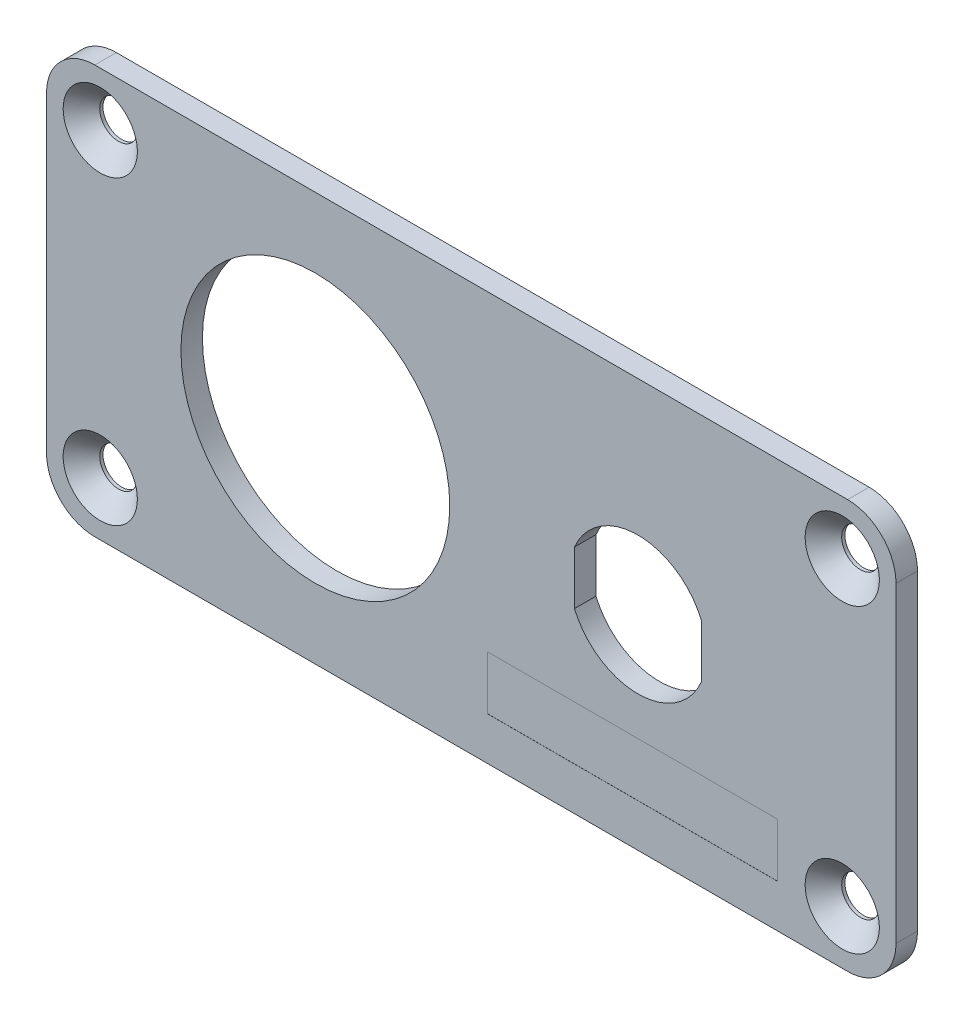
ISO-10303-21;
HEADER;
FILE_DESCRIPTION(('STEP AP214'),'2;1');
FILE_NAME('part.step','',(''),(''),'','','');
FILE_SCHEMA(('AUTOMOTIVE_DESIGN { 1 0 10303 214 1 1 1 1 }'));
ENDSEC;
DATA;
#1=APPLICATION_CONTEXT('core data for automotive mechanical design processes');
#2=APPLICATION_PROTOCOL_DEFINITION('international standard','automotive_design',2000,#1);
#3=PRODUCT_CONTEXT('',#1,'mechanical');
#4=PRODUCT('Part','Part','',(#3));
#5=PRODUCT_RELATED_PRODUCT_CATEGORY('part','',(#4));
#6=PRODUCT_DEFINITION_FORMATION('','',#4);
#7=PRODUCT_DEFINITION_CONTEXT('part definition',#1,'design');
#8=PRODUCT_DEFINITION('design','',#6,#7);
#9=PRODUCT_DEFINITION_SHAPE('','',#8);
#10=(LENGTH_UNIT() NAMED_UNIT(*) SI_UNIT(.MILLI.,.METRE.));
#11=(NAMED_UNIT(*) PLANE_ANGLE_UNIT() SI_UNIT($,.RADIAN.));
#12=(NAMED_UNIT(*) SI_UNIT($,.STERADIAN.) SOLID_ANGLE_UNIT());
#13=UNCERTAINTY_MEASURE_WITH_UNIT(LENGTH_MEASURE(1.E-05),#10,'distance_accuracy_value','');
#14=(GEOMETRIC_REPRESENTATION_CONTEXT(3) GLOBAL_UNCERTAINTY_ASSIGNED_CONTEXT((#13)) GLOBAL_UNIT_ASSIGNED_CONTEXT((#10,
#11,#12)) REPRESENTATION_CONTEXT('',''));
#15=CARTESIAN_POINT('',(0.,0.,0.));
#16=DIRECTION('',(0.,0.,1.));
#17=DIRECTION('',(1.,0.,0.));
#18=AXIS2_PLACEMENT_3D('',#15,#16,#17);
#19=CARTESIAN_POINT('',(0.,0.,2.));
#20=DIRECTION('',(1.,0.,0.));
#21=DIRECTION('',(0.,0.,-1.));
#22=AXIS2_PLACEMENT_3D('',#19,#20,#21);
#23=PLANE('',#22);
#24=DIRECTION('',(0.,-1.,0.));
#25=VECTOR('',#24,1.);
#26=CARTESIAN_POINT('',(0.,0.,2.));
#27=LINE('',#26,#25);
#28=CARTESIAN_POINT('',(0.,33.5,2.));
#29=VERTEX_POINT('',#28);
#30=CARTESIAN_POINT('',(0.,4.5,2.));
#31=VERTEX_POINT('',#30);
#32=EDGE_CURVE('E244',#29,#31,#27,.T.);
#33=ORIENTED_EDGE('',*,*,#32,.F.);
#34=DIRECTION('',(0.,0.,-1.));
#35=VECTOR('',#34,1.);
#36=CARTESIAN_POINT('',(0.,33.5,2.));
#37=LINE('',#36,#35);
#38=CARTESIAN_POINT('',(0.,33.5,0.));
#39=VERTEX_POINT('',#38);
#40=EDGE_CURVE('E300',#29,#39,#37,.T.);
#41=ORIENTED_EDGE('',*,*,#40,.T.);
#42=DIRECTION('',(0.,-1.,0.));
#43=VECTOR('',#42,1.);
#44=CARTESIAN_POINT('',(0.,0.,0.));
#45=LINE('',#44,#43);
#46=CARTESIAN_POINT('',(0.,4.5,0.));
#47=VERTEX_POINT('',#46);
#48=EDGE_CURVE('E243',#39,#47,#45,.T.);
#49=ORIENTED_EDGE('',*,*,#48,.T.);
#50=DIRECTION('',(0.,0.,-1.));
#51=VECTOR('',#50,1.);
#52=CARTESIAN_POINT('',(0.,4.5,2.));
#53=LINE('',#52,#51);
#54=EDGE_CURVE('E298',#47,#31,#53,.F.);
#55=ORIENTED_EDGE('',*,*,#54,.T.);
#56=EDGE_LOOP('',(#33,#41,#49,#55));
#57=FACE_BOUND('',#56,.T.);
#58=ADVANCED_FACE('F44',(#57),#23,.F.);
#59=CARTESIAN_POINT('',(0.,0.,2.));
#60=DIRECTION('',(0.,1.,0.));
#61=DIRECTION('',(0.,0.,1.));
#62=AXIS2_PLACEMENT_3D('',#59,#60,#61);
#63=PLANE('',#62);
#64=DIRECTION('',(1.,0.,0.));
#65=VECTOR('',#64,1.);
#66=CARTESIAN_POINT('',(0.,0.,0.));
#67=LINE('',#66,#65);
#68=CARTESIAN_POINT('',(4.5,0.,0.));
#69=VERTEX_POINT('',#68);
#70=CARTESIAN_POINT('',(74.5,0.,0.));
#71=VERTEX_POINT('',#70);
#72=EDGE_CURVE('E260',#69,#71,#67,.T.);
#73=ORIENTED_EDGE('',*,*,#72,.T.);
#74=DIRECTION('',(0.,0.,-1.));
#75=VECTOR('',#74,1.);
#76=CARTESIAN_POINT('',(74.5,0.,2.));
#77=LINE('',#76,#75);
#78=CARTESIAN_POINT('',(74.5,0.,2.));
#79=VERTEX_POINT('',#78);
#80=EDGE_CURVE('E283',#71,#79,#77,.F.);
#81=ORIENTED_EDGE('',*,*,#80,.T.);
#82=DIRECTION('',(1.,0.,0.));
#83=VECTOR('',#82,1.);
#84=CARTESIAN_POINT('',(0.,0.,2.));
#85=LINE('',#84,#83);
#86=CARTESIAN_POINT('',(4.5,0.,2.));
#87=VERTEX_POINT('',#86);
#88=EDGE_CURVE('E247',#87,#79,#85,.T.);
#89=ORIENTED_EDGE('',*,*,#88,.F.);
#90=DIRECTION('',(0.,0.,-1.));
#91=VECTOR('',#90,1.);
#92=CARTESIAN_POINT('',(4.5,0.,2.));
#93=LINE('',#92,#91);
#94=EDGE_CURVE('E280',#87,#69,#93,.T.);
#95=ORIENTED_EDGE('',*,*,#94,.T.);
#96=EDGE_LOOP('',(#73,#81,#89,#95));
#97=FACE_BOUND('',#96,.T.);
#98=ADVANCED_FACE('F340',(#97),#63,.F.);
#99=CARTESIAN_POINT('',(79.,0.,2.));
#100=DIRECTION('',(-1.,0.,0.));
#101=DIRECTION('',(0.,0.,1.));
#102=AXIS2_PLACEMENT_3D('',#99,#100,#101);
#103=PLANE('',#102);
#104=DIRECTION('',(0.,1.,0.));
#105=VECTOR('',#104,1.);
#106=CARTESIAN_POINT('',(79.,0.,2.));
#107=LINE('',#106,#105);
#108=CARTESIAN_POINT('',(79.,4.5,2.));
#109=VERTEX_POINT('',#108);
#110=CARTESIAN_POINT('',(79.,33.5,2.));
#111=VERTEX_POINT('',#110);
#112=EDGE_CURVE('E251',#109,#111,#107,.T.);
#113=ORIENTED_EDGE('',*,*,#112,.F.);
#114=DIRECTION('',(0.,0.,-1.));
#115=VECTOR('',#114,1.);
#116=CARTESIAN_POINT('',(79.,4.5,2.));
#117=LINE('',#116,#115);
#118=CARTESIAN_POINT('',(79.,4.5,0.));
#119=VERTEX_POINT('',#118);
#120=EDGE_CURVE('E269',#109,#119,#117,.T.);
#121=ORIENTED_EDGE('',*,*,#120,.T.);
#122=DIRECTION('',(0.,1.,0.));
#123=VECTOR('',#122,1.);
#124=CARTESIAN_POINT('',(79.,0.,0.));
#125=LINE('',#124,#123);
#126=CARTESIAN_POINT('',(79.,33.5,0.));
#127=VERTEX_POINT('',#126);
#128=EDGE_CURVE('E263',#119,#127,#125,.T.);
#129=ORIENTED_EDGE('',*,*,#128,.T.);
#130=DIRECTION('',(0.,0.,-1.));
#131=VECTOR('',#130,1.);
#132=CARTESIAN_POINT('',(79.,33.5,2.));
#133=LINE('',#132,#131);
#134=EDGE_CURVE('E257',#127,#111,#133,.F.);
#135=ORIENTED_EDGE('',*,*,#134,.T.);
#136=EDGE_LOOP('',(#113,#121,#129,#135));
#137=FACE_BOUND('',#136,.T.);
#138=ADVANCED_FACE('F346',(#137),#103,.F.);
#139=CARTESIAN_POINT('',(0.,38.,2.));
#140=DIRECTION('',(0.,-1.,0.));
#141=DIRECTION('',(0.,0.,-1.));
#142=AXIS2_PLACEMENT_3D('',#139,#140,#141);
#143=PLANE('',#142);
#144=DIRECTION('',(-1.,0.,0.));
#145=VECTOR('',#144,1.);
#146=CARTESIAN_POINT('',(0.,38.,2.));
#147=LINE('',#146,#145);
#148=CARTESIAN_POINT('',(74.5,38.,2.));
#149=VERTEX_POINT('',#148);
#150=CARTESIAN_POINT('',(4.5,38.,2.));
#151=VERTEX_POINT('',#150);
#152=EDGE_CURVE('E254',#149,#151,#147,.T.);
#153=ORIENTED_EDGE('',*,*,#152,.F.);
#154=DIRECTION('',(0.,0.,-1.));
#155=VECTOR('',#154,1.);
#156=CARTESIAN_POINT('',(74.5,38.,2.));
#157=LINE('',#156,#155);
#158=CARTESIAN_POINT('',(74.5,38.,0.));
#159=VERTEX_POINT('',#158);
#160=EDGE_CURVE('E295',#149,#159,#157,.T.);
#161=ORIENTED_EDGE('',*,*,#160,.T.);
#162=DIRECTION('',(-1.,0.,0.));
#163=VECTOR('',#162,1.);
#164=CARTESIAN_POINT('',(0.,38.,0.));
#165=LINE('',#164,#163);
#166=CARTESIAN_POINT('',(4.5,38.,0.));
#167=VERTEX_POINT('',#166);
#168=EDGE_CURVE('E248',#159,#167,#165,.T.);
#169=ORIENTED_EDGE('',*,*,#168,.T.);
#170=DIRECTION('',(0.,0.,-1.));
#171=VECTOR('',#170,1.);
#172=CARTESIAN_POINT('',(4.5,38.,2.));
#173=LINE('',#172,#171);
#174=EDGE_CURVE('E293',#167,#151,#173,.F.);
#175=ORIENTED_EDGE('',*,*,#174,.T.);
#176=EDGE_LOOP('',(#153,#161,#169,#175));
#177=FACE_BOUND('',#176,.T.);
#178=ADVANCED_FACE('F412',(#177),#143,.F.);
#179=CARTESIAN_POINT('',(0.,0.,2.));
#180=DIRECTION('',(0.,0.,-1.));
#181=DIRECTION('',(-1.,0.,0.));
#182=AXIS2_PLACEMENT_3D('',#179,#180,#181);
#183=PLANE('',#182);
#184=DIRECTION('',(1.,0.,0.));
#185=VECTOR('',#184,1.);
#186=CARTESIAN_POINT('',(41.,4.,2.));
#187=LINE('',#186,#185);
#188=CARTESIAN_POINT('',(41.,4.,2.));
#189=VERTEX_POINT('',#188);
#190=CARTESIAN_POINT('',(68.,4.,2.));
#191=VERTEX_POINT('',#190);
#192=EDGE_CURVE('E186',#189,#191,#187,.T.);
#193=ORIENTED_EDGE('',*,*,#192,.F.);
#194=DIRECTION('',(0.,-1.,0.));
#195=VECTOR('',#194,1.);
#196=CARTESIAN_POINT('',(41.,9.,2.));
#197=LINE('',#196,#195);
#198=CARTESIAN_POINT('',(41.,9.,2.));
#199=VERTEX_POINT('',#198);
#200=EDGE_CURVE('E59',#199,#189,#197,.T.);
#201=ORIENTED_EDGE('',*,*,#200,.F.);
#202=DIRECTION('',(-1.,0.,0.));
#203=VECTOR('',#202,1.);
#204=CARTESIAN_POINT('',(41.,9.,2.));
#205=LINE('',#204,#203);
#206=CARTESIAN_POINT('',(68.,9.,2.));
#207=VERTEX_POINT('',#206);
#208=EDGE_CURVE('E177',#207,#199,#205,.T.);
#209=ORIENTED_EDGE('',*,*,#208,.F.);
#210=DIRECTION('',(0.,1.,0.));
#211=VECTOR('',#210,1.);
#212=CARTESIAN_POINT('',(68.,9.,2.));
#213=LINE('',#212,#211);
#214=EDGE_CURVE('E180',#191,#207,#213,.T.);
#215=ORIENTED_EDGE('',*,*,#214,.F.);
#216=EDGE_LOOP('',(#193,#201,#209,#215));
#217=FACE_BOUND('',#216,.T.);
#218=CARTESIAN_POINT('',(74.,33.,2.));
#219=DIRECTION('',(0.,0.,-1.));
#220=DIRECTION('',(-1.,0.,0.));
#221=AXIS2_PLACEMENT_3D('',#218,#219,#220);
#222=CIRCLE('',#221,3.44999999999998);
#223=CARTESIAN_POINT('',(70.55,33.,2.));
#224=VERTEX_POINT('',#223);
#225=EDGE_CURVE('E315',#224,#224,#222,.T.);
#226=ORIENTED_EDGE('',*,*,#225,.T.);
#227=EDGE_LOOP('',(#226));
#228=FACE_BOUND('',#227,.T.);
#229=CARTESIAN_POINT('',(74.,5.,2.));
#230=DIRECTION('',(0.,0.,-1.));
#231=DIRECTION('',(-1.,0.,0.));
#232=AXIS2_PLACEMENT_3D('',#229,#230,#231);
#233=CIRCLE('',#232,3.44999999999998);
#234=CARTESIAN_POINT('',(70.55,5.,2.));
#235=VERTEX_POINT('',#234);
#236=EDGE_CURVE('E312',#235,#235,#233,.T.);
#237=ORIENTED_EDGE('',*,*,#236,.T.);
#238=EDGE_LOOP('',(#237));
#239=FACE_BOUND('',#238,.T.);
#240=CARTESIAN_POINT('',(5.,5.,2.));
#241=DIRECTION('',(0.,0.,-1.));
#242=DIRECTION('',(-1.,0.,0.));
#243=AXIS2_PLACEMENT_3D('',#240,#241,#242);
#244=CIRCLE('',#243,3.44999999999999);
#245=CARTESIAN_POINT('',(8.44999999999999,5.,2.));
#246=VERTEX_POINT('',#245);
#247=EDGE_CURVE('E309',#246,#246,#244,.T.);
#248=ORIENTED_EDGE('',*,*,#247,.T.);
#249=EDGE_LOOP('',(#248));
#250=FACE_BOUND('',#249,.T.);
#251=CARTESIAN_POINT('',(4.99999999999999,33.,2.));
#252=DIRECTION('',(0.,0.,-1.));
#253=DIRECTION('',(-1.,0.,0.));
#254=AXIS2_PLACEMENT_3D('',#251,#252,#253);
#255=CIRCLE('',#254,3.45000000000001);
#256=CARTESIAN_POINT('',(1.54999999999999,33.,2.));
#257=VERTEX_POINT('',#256);
#258=EDGE_CURVE('E306',#257,#257,#255,.T.);
#259=ORIENTED_EDGE('',*,*,#258,.T.);
#260=EDGE_LOOP('',(#259));
#261=FACE_BOUND('',#260,.T.);
#262=CARTESIAN_POINT('',(25.,19.,2.));
#263=DIRECTION('',(0.,0.,1.));
#264=DIRECTION('',(1.,0.,0.));
#265=AXIS2_PLACEMENT_3D('',#262,#263,#264);
#266=CIRCLE('',#265,12.5);
#267=CARTESIAN_POINT('',(37.5,19.,2.));
#268=VERTEX_POINT('',#267);
#269=EDGE_CURVE('E199',#268,#268,#266,.T.);
#270=ORIENTED_EDGE('',*,*,#269,.F.);
#271=EDGE_LOOP('',(#270));
#272=FACE_BOUND('',#271,.T.);
#273=DIRECTION('',(0.,-1.,0.));
#274=VECTOR('',#273,1.);
#275=CARTESIAN_POINT('',(49.1,21.4799193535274,2.));
#276=LINE('',#275,#274);
#277=CARTESIAN_POINT('',(49.1,21.4799193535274,2.));
#278=VERTEX_POINT('',#277);
#279=CARTESIAN_POINT('',(49.1,16.5200806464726,2.));
#280=VERTEX_POINT('',#279);
#281=EDGE_CURVE('E218',#278,#280,#276,.T.);
#282=ORIENTED_EDGE('',*,*,#281,.F.);
#283=CARTESIAN_POINT('',(55.,19.,2.));
#284=DIRECTION('',(0.,0.,1.));
#285=DIRECTION('',(1.,0.,0.));
#286=AXIS2_PLACEMENT_3D('',#283,#284,#285);
#287=CIRCLE('',#286,6.4);
#288=CARTESIAN_POINT('',(60.9,21.4799193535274,2.));
#289=VERTEX_POINT('',#288);
#290=EDGE_CURVE('E67',#289,#278,#287,.T.);
#291=ORIENTED_EDGE('',*,*,#290,.F.);
#292=DIRECTION('',(0.,1.,0.));
#293=VECTOR('',#292,1.);
#294=CARTESIAN_POINT('',(60.9,21.4799193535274,2.));
#295=LINE('',#294,#293);
#296=CARTESIAN_POINT('',(60.9,16.5200806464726,2.));
#297=VERTEX_POINT('',#296);
#298=EDGE_CURVE('E207',#297,#289,#295,.T.);
#299=ORIENTED_EDGE('',*,*,#298,.F.);
#300=CARTESIAN_POINT('',(55.,19.,2.));
#301=DIRECTION('',(0.,0.,1.));
#302=DIRECTION('',(1.,0.,0.));
#303=AXIS2_PLACEMENT_3D('',#300,#301,#302);
#304=CIRCLE('',#303,6.4);
#305=EDGE_CURVE('E221',#280,#297,#304,.T.);
#306=ORIENTED_EDGE('',*,*,#305,.F.);
#307=EDGE_LOOP('',(#282,#291,#299,#306));
#308=FACE_BOUND('',#307,.T.);
#309=ORIENTED_EDGE('',*,*,#88,.T.);
#310=CARTESIAN_POINT('',(74.5,4.5,2.));
#311=DIRECTION('',(0.,0.,-1.));
#312=DIRECTION('',(-1.,0.,0.));
#313=AXIS2_PLACEMENT_3D('',#310,#311,#312);
#314=CIRCLE('',#313,4.5);
#315=EDGE_CURVE('E291',#79,#109,#314,.F.);
#316=ORIENTED_EDGE('',*,*,#315,.T.);
#317=ORIENTED_EDGE('',*,*,#112,.T.);
#318=CARTESIAN_POINT('',(74.5,33.5,2.));
#319=DIRECTION('',(0.,0.,-1.));
#320=DIRECTION('',(-1.,0.,0.));
#321=AXIS2_PLACEMENT_3D('',#318,#319,#320);
#322=CIRCLE('',#321,4.5);
#323=EDGE_CURVE('E289',#111,#149,#322,.F.);
#324=ORIENTED_EDGE('',*,*,#323,.T.);
#325=ORIENTED_EDGE('',*,*,#152,.T.);
#326=CARTESIAN_POINT('',(4.5,33.5,2.));
#327=DIRECTION('',(0.,0.,-1.));
#328=DIRECTION('',(-1.,0.,0.));
#329=AXIS2_PLACEMENT_3D('',#326,#327,#328);
#330=CIRCLE('',#329,4.5);
#331=EDGE_CURVE('E287',#151,#29,#330,.F.);
#332=ORIENTED_EDGE('',*,*,#331,.T.);
#333=ORIENTED_EDGE('',*,*,#32,.T.);
#334=CARTESIAN_POINT('',(4.5,4.5,2.));
#335=DIRECTION('',(0.,0.,-1.));
#336=DIRECTION('',(-1.,0.,0.));
#337=AXIS2_PLACEMENT_3D('',#334,#335,#336);
#338=CIRCLE('',#337,4.5);
#339=EDGE_CURVE('E285',#31,#87,#338,.F.);
#340=ORIENTED_EDGE('',*,*,#339,.T.);
#341=EDGE_LOOP('',(#309,#316,#317,#324,#325,#332,#333,#340));
#342=FACE_BOUND('',#341,.T.);
#343=ADVANCED_FACE('F392',(#217,#228,#239,#250,#261,#272,#308,#342),#183,.F.);
#344=CARTESIAN_POINT('',(0.,0.,0.));
#345=DIRECTION('',(0.,0.,-1.));
#346=DIRECTION('',(-1.,0.,0.));
#347=AXIS2_PLACEMENT_3D('',#344,#345,#346);
#348=PLANE('',#347);
#349=CARTESIAN_POINT('',(25.,19.,0.));
#350=DIRECTION('',(0.,0.,1.));
#351=DIRECTION('',(1.,0.,0.));
#352=AXIS2_PLACEMENT_3D('',#349,#350,#351);
#353=CIRCLE('',#352,12.5);
#354=CARTESIAN_POINT('',(37.5,19.,0.));
#355=VERTEX_POINT('',#354);
#356=EDGE_CURVE('E195',#355,#355,#353,.T.);
#357=ORIENTED_EDGE('',*,*,#356,.T.);
#358=EDGE_LOOP('',(#357));
#359=FACE_BOUND('',#358,.T.);
#360=CARTESIAN_POINT('',(55.,19.,0.));
#361=DIRECTION('',(0.,0.,1.));
#362=DIRECTION('',(1.,0.,0.));
#363=AXIS2_PLACEMENT_3D('',#360,#361,#362);
#364=CIRCLE('',#363,6.4);
#365=CARTESIAN_POINT('',(60.9,21.4799193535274,0.));
#366=VERTEX_POINT('',#365);
#367=CARTESIAN_POINT('',(49.1,21.4799193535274,0.));
#368=VERTEX_POINT('',#367);
#369=EDGE_CURVE('E203',#366,#368,#364,.T.);
#370=ORIENTED_EDGE('',*,*,#369,.T.);
#371=DIRECTION('',(0.,-1.,0.));
#372=VECTOR('',#371,1.);
#373=CARTESIAN_POINT('',(49.1,21.4799193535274,0.));
#374=LINE('',#373,#372);
#375=CARTESIAN_POINT('',(49.1,16.5200806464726,0.));
#376=VERTEX_POINT('',#375);
#377=EDGE_CURVE('E206',#368,#376,#374,.T.);
#378=ORIENTED_EDGE('',*,*,#377,.T.);
#379=CARTESIAN_POINT('',(55.,19.,0.));
#380=DIRECTION('',(0.,0.,1.));
#381=DIRECTION('',(1.,0.,0.));
#382=AXIS2_PLACEMENT_3D('',#379,#380,#381);
#383=CIRCLE('',#382,6.4);
#384=CARTESIAN_POINT('',(60.9,16.5200806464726,0.));
#385=VERTEX_POINT('',#384);
#386=EDGE_CURVE('E210',#376,#385,#383,.T.);
#387=ORIENTED_EDGE('',*,*,#386,.T.);
#388=DIRECTION('',(0.,1.,0.));
#389=VECTOR('',#388,1.);
#390=CARTESIAN_POINT('',(60.9,21.4799193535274,0.));
#391=LINE('',#390,#389);
#392=EDGE_CURVE('E213',#385,#366,#391,.T.);
#393=ORIENTED_EDGE('',*,*,#392,.T.);
#394=EDGE_LOOP('',(#370,#378,#387,#393));
#395=FACE_BOUND('',#394,.T.);
#396=CARTESIAN_POINT('',(5.,5.,0.));
#397=DIRECTION('',(0.,0.,1.));
#398=DIRECTION('',(1.,0.,0.));
#399=AXIS2_PLACEMENT_3D('',#396,#397,#398);
#400=CIRCLE('',#399,1.75);
#401=CARTESIAN_POINT('',(6.75,5.,0.));
#402=VERTEX_POINT('',#401);
#403=EDGE_CURVE('E235',#402,#402,#400,.T.);
#404=ORIENTED_EDGE('',*,*,#403,.T.);
#405=EDGE_LOOP('',(#404));
#406=FACE_BOUND('',#405,.T.);
#407=CARTESIAN_POINT('',(74.,33.,0.));
#408=DIRECTION('',(0.,0.,1.));
#409=DIRECTION('',(1.,0.,0.));
#410=AXIS2_PLACEMENT_3D('',#407,#408,#409);
#411=CIRCLE('',#410,1.75);
#412=CARTESIAN_POINT('',(75.75,33.,0.));
#413=VERTEX_POINT('',#412);
#414=EDGE_CURVE('E234',#413,#413,#411,.T.);
#415=ORIENTED_EDGE('',*,*,#414,.T.);
#416=EDGE_LOOP('',(#415));
#417=FACE_BOUND('',#416,.T.);
#418=CARTESIAN_POINT('',(74.,5.,0.));
#419=DIRECTION('',(0.,0.,1.));
#420=DIRECTION('',(1.,0.,0.));
#421=AXIS2_PLACEMENT_3D('',#418,#419,#420);
#422=CIRCLE('',#421,1.75);
#423=CARTESIAN_POINT('',(75.75,5.,0.));
#424=VERTEX_POINT('',#423);
#425=EDGE_CURVE('E198',#424,#424,#422,.T.);
#426=ORIENTED_EDGE('',*,*,#425,.T.);
#427=EDGE_LOOP('',(#426));
#428=FACE_BOUND('',#427,.T.);
#429=CARTESIAN_POINT('',(4.99999999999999,33.,0.));
#430=DIRECTION('',(0.,0.,1.));
#431=DIRECTION('',(1.,0.,0.));
#432=AXIS2_PLACEMENT_3D('',#429,#430,#431);
#433=CIRCLE('',#432,1.75);
#434=CARTESIAN_POINT('',(6.75,33.,0.));
#435=VERTEX_POINT('',#434);
#436=EDGE_CURVE('E238',#435,#435,#433,.T.);
#437=ORIENTED_EDGE('',*,*,#436,.T.);
#438=EDGE_LOOP('',(#437));
#439=FACE_BOUND('',#438,.T.);
#440=ORIENTED_EDGE('',*,*,#128,.F.);
#441=CARTESIAN_POINT('',(74.5,4.5,0.));
#442=DIRECTION('',(0.,0.,-1.));
#443=DIRECTION('',(-1.,0.,0.));
#444=AXIS2_PLACEMENT_3D('',#441,#442,#443);
#445=CIRCLE('',#444,4.5);
#446=EDGE_CURVE('E278',#119,#71,#445,.T.);
#447=ORIENTED_EDGE('',*,*,#446,.T.);
#448=ORIENTED_EDGE('',*,*,#72,.F.);
#449=CARTESIAN_POINT('',(4.5,4.5,0.));
#450=DIRECTION('',(0.,0.,-1.));
#451=DIRECTION('',(-1.,0.,0.));
#452=AXIS2_PLACEMENT_3D('',#449,#450,#451);
#453=CIRCLE('',#452,4.5);
#454=EDGE_CURVE('E272',#69,#47,#453,.T.);
#455=ORIENTED_EDGE('',*,*,#454,.T.);
#456=ORIENTED_EDGE('',*,*,#48,.F.);
#457=CARTESIAN_POINT('',(4.5,33.5,0.));
#458=DIRECTION('',(0.,0.,-1.));
#459=DIRECTION('',(-1.,0.,0.));
#460=AXIS2_PLACEMENT_3D('',#457,#458,#459);
#461=CIRCLE('',#460,4.5);
#462=EDGE_CURVE('E274',#39,#167,#461,.T.);
#463=ORIENTED_EDGE('',*,*,#462,.T.);
#464=ORIENTED_EDGE('',*,*,#168,.F.);
#465=CARTESIAN_POINT('',(74.5,33.5,0.));
#466=DIRECTION('',(0.,0.,-1.));
#467=DIRECTION('',(-1.,0.,0.));
#468=AXIS2_PLACEMENT_3D('',#465,#466,#467);
#469=CIRCLE('',#468,4.5);
#470=EDGE_CURVE('E276',#159,#127,#469,.T.);
#471=ORIENTED_EDGE('',*,*,#470,.T.);
#472=EDGE_LOOP('',(#440,#447,#448,#455,#456,#463,#464,#471));
#473=FACE_BOUND('',#472,.T.);
#474=ADVANCED_FACE('F356',(#359,#395,#406,#417,#428,#439,#473),#348,.T.);
#475=CARTESIAN_POINT('',(74.5,4.5,2.));
#476=DIRECTION('',(0.,0.,-1.));
#477=DIRECTION('',(-1.,0.,0.));
#478=AXIS2_PLACEMENT_3D('',#475,#476,#477);
#479=CYLINDRICAL_SURFACE('',#478,4.5);
#480=ORIENTED_EDGE('',*,*,#315,.F.);
#481=ORIENTED_EDGE('',*,*,#80,.F.);
#482=ORIENTED_EDGE('',*,*,#446,.F.);
#483=ORIENTED_EDGE('',*,*,#120,.F.);
#484=EDGE_LOOP('',(#480,#481,#482,#483));
#485=FACE_BOUND('',#484,.T.);
#486=ADVANCED_FACE('F352',(#485),#479,.T.);
#487=CARTESIAN_POINT('',(74.5,33.5,2.));
#488=DIRECTION('',(0.,0.,-1.));
#489=DIRECTION('',(-1.,0.,0.));
#490=AXIS2_PLACEMENT_3D('',#487,#488,#489);
#491=CYLINDRICAL_SURFACE('',#490,4.5);
#492=ORIENTED_EDGE('',*,*,#323,.F.);
#493=ORIENTED_EDGE('',*,*,#134,.F.);
#494=ORIENTED_EDGE('',*,*,#470,.F.);
#495=ORIENTED_EDGE('',*,*,#160,.F.);
#496=EDGE_LOOP('',(#492,#493,#494,#495));
#497=FACE_BOUND('',#496,.T.);
#498=ADVANCED_FACE('F355',(#497),#491,.T.);
#499=CARTESIAN_POINT('',(4.5,33.5,2.));
#500=DIRECTION('',(0.,0.,-1.));
#501=DIRECTION('',(-1.,0.,0.));
#502=AXIS2_PLACEMENT_3D('',#499,#500,#501);
#503=CYLINDRICAL_SURFACE('',#502,4.5);
#504=ORIENTED_EDGE('',*,*,#331,.F.);
#505=ORIENTED_EDGE('',*,*,#174,.F.);
#506=ORIENTED_EDGE('',*,*,#462,.F.);
#507=ORIENTED_EDGE('',*,*,#40,.F.);
#508=EDGE_LOOP('',(#504,#505,#506,#507));
#509=FACE_BOUND('',#508,.T.);
#510=ADVANCED_FACE('F360',(#509),#503,.T.);
#511=CARTESIAN_POINT('',(4.5,4.5,2.));
#512=DIRECTION('',(0.,0.,-1.));
#513=DIRECTION('',(-1.,0.,0.));
#514=AXIS2_PLACEMENT_3D('',#511,#512,#513);
#515=CYLINDRICAL_SURFACE('',#514,4.5);
#516=ORIENTED_EDGE('',*,*,#339,.F.);
#517=ORIENTED_EDGE('',*,*,#54,.F.);
#518=ORIENTED_EDGE('',*,*,#454,.F.);
#519=ORIENTED_EDGE('',*,*,#94,.F.);
#520=EDGE_LOOP('',(#516,#517,#518,#519));
#521=FACE_BOUND('',#520,.T.);
#522=ADVANCED_FACE('F364',(#521),#515,.T.);
#523=CARTESIAN_POINT('',(4.99999999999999,33.,0.));
#524=DIRECTION('',(0.,0.,1.));
#525=DIRECTION('',(1.,0.,0.));
#526=AXIS2_PLACEMENT_3D('',#523,#524,#525);
#527=CYLINDRICAL_SURFACE('',#526,1.75);
#528=CARTESIAN_POINT('',(4.99999999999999,33.,0.3));
#529=DIRECTION('',(0.,0.,-1.));
#530=DIRECTION('',(-1.,0.,0.));
#531=AXIS2_PLACEMENT_3D('',#528,#529,#530);
#532=CIRCLE('',#531,1.75);
#533=CARTESIAN_POINT('',(3.24999999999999,33.,0.3));
#534=VERTEX_POINT('',#533);
#535=EDGE_CURVE('E11',#534,#534,#532,.F.);
#536=ORIENTED_EDGE('',*,*,#535,.T.);
#537=EDGE_LOOP('',(#536));
#538=FACE_BOUND('',#537,.T.);
#539=ORIENTED_EDGE('',*,*,#436,.F.);
#540=EDGE_LOOP('',(#539));
#541=FACE_BOUND('',#540,.T.);
#542=ADVANCED_FACE('F368',(#538,#541),#527,.F.);
#543=CARTESIAN_POINT('',(74.,5.,0.));
#544=DIRECTION('',(0.,0.,1.));
#545=DIRECTION('',(1.,0.,0.));
#546=AXIS2_PLACEMENT_3D('',#543,#544,#545);
#547=CYLINDRICAL_SURFACE('',#546,1.75);
#548=CARTESIAN_POINT('',(74.,5.,0.300000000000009));
#549=DIRECTION('',(0.,0.,-1.));
#550=DIRECTION('',(-1.,0.,0.));
#551=AXIS2_PLACEMENT_3D('',#548,#549,#550);
#552=CIRCLE('',#551,1.75);
#553=CARTESIAN_POINT('',(72.25,5.,0.300000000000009));
#554=VERTEX_POINT('',#553);
#555=EDGE_CURVE('E318',#554,#554,#552,.F.);
#556=ORIENTED_EDGE('',*,*,#555,.T.);
#557=EDGE_LOOP('',(#556));
#558=FACE_BOUND('',#557,.T.);
#559=ORIENTED_EDGE('',*,*,#425,.F.);
#560=EDGE_LOOP('',(#559));
#561=FACE_BOUND('',#560,.T.);
#562=ADVANCED_FACE('F386',(#558,#561),#547,.F.);
#563=CARTESIAN_POINT('',(74.,33.,0.));
#564=DIRECTION('',(0.,0.,1.));
#565=DIRECTION('',(1.,0.,0.));
#566=AXIS2_PLACEMENT_3D('',#563,#564,#565);
#567=CYLINDRICAL_SURFACE('',#566,1.75);
#568=CARTESIAN_POINT('',(74.,33.,0.300000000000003));
#569=DIRECTION('',(0.,0.,-1.));
#570=DIRECTION('',(-1.,0.,0.));
#571=AXIS2_PLACEMENT_3D('',#568,#569,#570);
#572=CIRCLE('',#571,1.75);
#573=CARTESIAN_POINT('',(72.25,33.,0.300000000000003));
#574=VERTEX_POINT('',#573);
#575=EDGE_CURVE('E303',#574,#574,#572,.F.);
#576=ORIENTED_EDGE('',*,*,#575,.T.);
#577=EDGE_LOOP('',(#576));
#578=FACE_BOUND('',#577,.T.);
#579=ORIENTED_EDGE('',*,*,#414,.F.);
#580=EDGE_LOOP('',(#579));
#581=FACE_BOUND('',#580,.T.);
#582=ADVANCED_FACE('F383',(#578,#581),#567,.F.);
#583=CARTESIAN_POINT('',(5.,5.,0.));
#584=DIRECTION('',(0.,0.,1.));
#585=DIRECTION('',(1.,0.,0.));
#586=AXIS2_PLACEMENT_3D('',#583,#584,#585);
#587=CYLINDRICAL_SURFACE('',#586,1.75);
#588=CARTESIAN_POINT('',(5.,5.,0.300000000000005));
#589=DIRECTION('',(0.,0.,-1.));
#590=DIRECTION('',(-1.,0.,0.));
#591=AXIS2_PLACEMENT_3D('',#588,#589,#590);
#592=CIRCLE('',#591,1.75);
#593=CARTESIAN_POINT('',(6.75,5.,0.300000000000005));
#594=VERTEX_POINT('',#593);
#595=EDGE_CURVE('E52',#594,#594,#592,.F.);
#596=ORIENTED_EDGE('',*,*,#595,.T.);
#597=EDGE_LOOP('',(#596));
#598=FACE_BOUND('',#597,.T.);
#599=ORIENTED_EDGE('',*,*,#403,.F.);
#600=EDGE_LOOP('',(#599));
#601=FACE_BOUND('',#600,.T.);
#602=ADVANCED_FACE('F323',(#598,#601),#587,.F.);
#603=CARTESIAN_POINT('',(55.,19.,0.));
#604=DIRECTION('',(0.,0.,1.));
#605=DIRECTION('',(1.,0.,0.));
#606=AXIS2_PLACEMENT_3D('',#603,#604,#605);
#607=CYLINDRICAL_SURFACE('',#606,6.4);
#608=ORIENTED_EDGE('',*,*,#290,.T.);
#609=DIRECTION('',(0.,0.,1.));
#610=VECTOR('',#609,1.);
#611=CARTESIAN_POINT('',(49.1,21.4799193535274,0.));
#612=LINE('',#611,#610);
#613=EDGE_CURVE('E216',#368,#278,#612,.T.);
#614=ORIENTED_EDGE('',*,*,#613,.F.);
#615=ORIENTED_EDGE('',*,*,#369,.F.);
#616=DIRECTION('',(0.,0.,1.));
#617=VECTOR('',#616,1.);
#618=CARTESIAN_POINT('',(60.9,21.4799193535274,0.));
#619=LINE('',#618,#617);
#620=EDGE_CURVE('E202',#366,#289,#619,.T.);
#621=ORIENTED_EDGE('',*,*,#620,.T.);
#622=EDGE_LOOP('',(#608,#614,#615,#621));
#623=FACE_BOUND('',#622,.T.);
#624=ADVANCED_FACE('F436',(#623),#607,.F.);
#625=CARTESIAN_POINT('',(60.9,21.4799193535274,0.));
#626=DIRECTION('',(1.,0.,0.));
#627=DIRECTION('',(0.,0.,-1.));
#628=AXIS2_PLACEMENT_3D('',#625,#626,#627);
#629=PLANE('',#628);
#630=ORIENTED_EDGE('',*,*,#298,.T.);
#631=ORIENTED_EDGE('',*,*,#620,.F.);
#632=ORIENTED_EDGE('',*,*,#392,.F.);
#633=DIRECTION('',(0.,0.,1.));
#634=VECTOR('',#633,1.);
#635=CARTESIAN_POINT('',(60.9,16.5200806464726,0.));
#636=LINE('',#635,#634);
#637=EDGE_CURVE('E227',#385,#297,#636,.T.);
#638=ORIENTED_EDGE('',*,*,#637,.T.);
#639=EDGE_LOOP('',(#630,#631,#632,#638));
#640=FACE_BOUND('',#639,.T.);
#641=ADVANCED_FACE('F442',(#640),#629,.F.);
#642=CARTESIAN_POINT('',(55.,19.,0.));
#643=DIRECTION('',(0.,0.,1.));
#644=DIRECTION('',(1.,0.,0.));
#645=AXIS2_PLACEMENT_3D('',#642,#643,#644);
#646=CYLINDRICAL_SURFACE('',#645,6.4);
#647=ORIENTED_EDGE('',*,*,#305,.T.);
#648=ORIENTED_EDGE('',*,*,#637,.F.);
#649=ORIENTED_EDGE('',*,*,#386,.F.);
#650=DIRECTION('',(0.,0.,1.));
#651=VECTOR('',#650,1.);
#652=CARTESIAN_POINT('',(49.1,16.5200806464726,0.));
#653=LINE('',#652,#651);
#654=EDGE_CURVE('E229',#376,#280,#653,.T.);
#655=ORIENTED_EDGE('',*,*,#654,.T.);
#656=EDGE_LOOP('',(#647,#648,#649,#655));
#657=FACE_BOUND('',#656,.T.);
#658=ADVANCED_FACE('F445',(#657),#646,.F.);
#659=CARTESIAN_POINT('',(49.1,21.4799193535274,0.));
#660=DIRECTION('',(-1.,0.,0.));
#661=DIRECTION('',(0.,0.,1.));
#662=AXIS2_PLACEMENT_3D('',#659,#660,#661);
#663=PLANE('',#662);
#664=ORIENTED_EDGE('',*,*,#281,.T.);
#665=ORIENTED_EDGE('',*,*,#654,.F.);
#666=ORIENTED_EDGE('',*,*,#377,.F.);
#667=ORIENTED_EDGE('',*,*,#613,.T.);
#668=EDGE_LOOP('',(#664,#665,#666,#667));
#669=FACE_BOUND('',#668,.T.);
#670=ADVANCED_FACE('F376',(#669),#663,.F.);
#671=CARTESIAN_POINT('',(25.,19.,0.));
#672=DIRECTION('',(0.,0.,1.));
#673=DIRECTION('',(1.,0.,0.));
#674=AXIS2_PLACEMENT_3D('',#671,#672,#673);
#675=CYLINDRICAL_SURFACE('',#674,12.5);
#676=ORIENTED_EDGE('',*,*,#356,.F.);
#677=EDGE_LOOP('',(#676));
#678=FACE_BOUND('',#677,.T.);
#679=ORIENTED_EDGE('',*,*,#269,.T.);
#680=EDGE_LOOP('',(#679));
#681=FACE_BOUND('',#680,.T.);
#682=ADVANCED_FACE('F371',(#678,#681),#675,.F.);
#683=CARTESIAN_POINT('',(74.,33.,0.300000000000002));
#684=DIRECTION('',(0.,0.,1.));
#685=DIRECTION('',(1.,0.,0.));
#686=AXIS2_PLACEMENT_3D('',#683,#684,#685);
#687=CONICAL_SURFACE('',#686,1.75,0.785398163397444);
#688=ORIENTED_EDGE('',*,*,#225,.F.);
#689=EDGE_LOOP('',(#688));
#690=FACE_BOUND('',#689,.T.);
#691=ORIENTED_EDGE('',*,*,#575,.F.);
#692=EDGE_LOOP('',(#691));
#693=FACE_BOUND('',#692,.T.);
#694=ADVANCED_FACE('F335',(#690,#693),#687,.F.);
#695=CARTESIAN_POINT('',(74.,5.,0.300000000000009));
#696=DIRECTION('',(0.,0.,1.));
#697=DIRECTION('',(1.,0.,0.));
#698=AXIS2_PLACEMENT_3D('',#695,#696,#697);
#699=CONICAL_SURFACE('',#698,1.75,0.785398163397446);
#700=ORIENTED_EDGE('',*,*,#236,.F.);
#701=EDGE_LOOP('',(#700));
#702=FACE_BOUND('',#701,.T.);
#703=ORIENTED_EDGE('',*,*,#555,.F.);
#704=EDGE_LOOP('',(#703));
#705=FACE_BOUND('',#704,.T.);
#706=ADVANCED_FACE('F328',(#702,#705),#699,.F.);
#707=CARTESIAN_POINT('',(5.,5.,0.300000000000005));
#708=DIRECTION('',(0.,0.,1.));
#709=DIRECTION('',(1.,0.,0.));
#710=AXIS2_PLACEMENT_3D('',#707,#708,#709);
#711=CONICAL_SURFACE('',#710,1.75,0.785398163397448);
#712=CARTESIAN_POINT('',(8.44999999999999,5.,2.));
#713=CARTESIAN_POINT('',(8.43229166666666,5.,1.98229166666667));
#714=CARTESIAN_POINT('',(8.41458333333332,5.,1.96458333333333));
#715=CARTESIAN_POINT('',(8.37916666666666,5.,1.92916666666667));
#716=CARTESIAN_POINT('',(8.36145833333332,5.,1.91145833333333));
#717=CARTESIAN_POINT('',(8.32604166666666,5.,1.87604166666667));
#718=CARTESIAN_POINT('',(8.30833333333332,5.,1.85833333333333));
#719=CARTESIAN_POINT('',(8.27291666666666,5.,1.82291666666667));
#720=CARTESIAN_POINT('',(8.25520833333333,5.,1.80520833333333));
#721=CARTESIAN_POINT('',(8.21979166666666,5.,1.76979166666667));
#722=CARTESIAN_POINT('',(8.20208333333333,5.,1.75208333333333));
#723=CARTESIAN_POINT('',(8.16666666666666,5.,1.71666666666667));
#724=CARTESIAN_POINT('',(8.14895833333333,5.,1.69895833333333));
#725=CARTESIAN_POINT('',(8.11354166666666,5.,1.66354166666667));
#726=CARTESIAN_POINT('',(8.09583333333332,5.,1.64583333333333));
#727=CARTESIAN_POINT('',(8.06041666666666,5.,1.61041666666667));
#728=CARTESIAN_POINT('',(8.04270833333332,5.,1.59270833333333));
#729=CARTESIAN_POINT('',(8.00729166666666,5.,1.55729166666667));
#730=CARTESIAN_POINT('',(7.98958333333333,5.,1.53958333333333));
#731=CARTESIAN_POINT('',(7.95416666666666,5.,1.50416666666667));
#732=CARTESIAN_POINT('',(7.93645833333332,5.,1.48645833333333));
#733=CARTESIAN_POINT('',(7.90104166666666,5.,1.45104166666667));
#734=CARTESIAN_POINT('',(7.88333333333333,5.,1.43333333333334));
#735=CARTESIAN_POINT('',(7.84791666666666,5.,1.39791666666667));
#736=CARTESIAN_POINT('',(7.83020833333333,5.,1.38020833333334));
#737=CARTESIAN_POINT('',(7.79479166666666,5.,1.34479166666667));
#738=CARTESIAN_POINT('',(7.77708333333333,5.,1.32708333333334));
#739=CARTESIAN_POINT('',(7.74166666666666,5.,1.29166666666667));
#740=CARTESIAN_POINT('',(7.72395833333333,5.,1.27395833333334));
#741=CARTESIAN_POINT('',(7.68854166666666,5.,1.23854166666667));
#742=CARTESIAN_POINT('',(7.67083333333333,5.,1.22083333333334));
#743=CARTESIAN_POINT('',(7.63541666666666,5.,1.18541666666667));
#744=CARTESIAN_POINT('',(7.61770833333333,5.,1.16770833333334));
#745=CARTESIAN_POINT('',(7.58229166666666,5.,1.13229166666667));
#746=CARTESIAN_POINT('',(7.56458333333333,5.,1.11458333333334));
#747=CARTESIAN_POINT('',(7.52916666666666,5.,1.07916666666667));
#748=CARTESIAN_POINT('',(7.51145833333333,5.,1.06145833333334));
#749=CARTESIAN_POINT('',(7.47604166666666,5.,1.02604166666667));
#750=CARTESIAN_POINT('',(7.45833333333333,5.,1.00833333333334));
#751=CARTESIAN_POINT('',(7.42291666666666,5.,0.97291666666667));
#752=CARTESIAN_POINT('',(7.40520833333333,5.,0.955208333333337));
#753=CARTESIAN_POINT('',(7.36979166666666,5.,0.91979166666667));
#754=CARTESIAN_POINT('',(7.35208333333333,5.,0.902083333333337));
#755=CARTESIAN_POINT('',(7.31666666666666,5.,0.86666666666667));
#756=CARTESIAN_POINT('',(7.29895833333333,5.,0.848958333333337));
#757=CARTESIAN_POINT('',(7.26354166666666,5.,0.81354166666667));
#758=CARTESIAN_POINT('',(7.24583333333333,5.,0.795833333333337));
#759=CARTESIAN_POINT('',(7.21041666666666,5.,0.760416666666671));
#760=CARTESIAN_POINT('',(7.19270833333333,5.,0.742708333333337));
#761=CARTESIAN_POINT('',(7.15729166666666,5.,0.707291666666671));
#762=CARTESIAN_POINT('',(7.13958333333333,5.,0.689583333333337));
#763=CARTESIAN_POINT('',(7.10416666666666,5.,0.654166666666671));
#764=CARTESIAN_POINT('',(7.08645833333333,5.,0.636458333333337));
#765=CARTESIAN_POINT('',(7.05104166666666,5.,0.601041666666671));
#766=CARTESIAN_POINT('',(7.03333333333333,5.,0.583333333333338));
#767=CARTESIAN_POINT('',(6.99791666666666,5.,0.547916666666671));
#768=CARTESIAN_POINT('',(6.98020833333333,5.,0.530208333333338));
#769=CARTESIAN_POINT('',(6.94479166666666,5.,0.494791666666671));
#770=CARTESIAN_POINT('',(6.92708333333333,5.,0.477083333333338));
#771=CARTESIAN_POINT('',(6.89166666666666,5.,0.441666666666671));
#772=CARTESIAN_POINT('',(6.87395833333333,5.,0.423958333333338));
#773=CARTESIAN_POINT('',(6.83854166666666,5.,0.388541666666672));
#774=CARTESIAN_POINT('',(6.82083333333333,5.,0.370833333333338));
#775=CARTESIAN_POINT('',(6.78541666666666,5.,0.335416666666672));
#776=CARTESIAN_POINT('',(6.76770833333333,5.,0.317708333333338));
#777=CARTESIAN_POINT('',(6.75,5.,0.300000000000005));
#778=B_SPLINE_CURVE_WITH_KNOTS('',3,(#712,#713,#714,#715,#716,#717,#718,#719,#720,#721,#722,
#723,#724,#725,#726,#727,#728,#729,#730,#731,#732,#733,#734,#735,#736,#737,#738,#739,#740,#741,
#742,#743,#744,#745,#746,#747,#748,#749,#750,#751,#752,#753,#754,#755,#756,#757,#758,#759,#760,
#761,#762,#763,#764,#765,#766,#767,#768,#769,#770,#771,#772,#773,#774,#775,#776,#777),
.UNSPECIFIED.,.F.,.F.,(4,2,2,2,2,2,2,2,2,2,2,2,2,2,2,2,2,2,2,2,2,2,2,2,2,2,2,2,2,2,2,2,4),(0.,
0.0751300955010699,0.150260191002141,0.22539028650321,0.300520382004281,0.375650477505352,
0.450780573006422,0.525910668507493,0.601040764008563,0.676170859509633,0.751300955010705,
0.826431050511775,0.901561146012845,0.976691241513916,1.05182133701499,1.12695143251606,
1.20208152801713,1.2772116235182,1.35234171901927,1.42747181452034,1.50260191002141,
1.57773200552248,1.65286210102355,1.72799219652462,1.80312229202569,1.87825238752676,
1.95338248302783,2.0285125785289,2.10364267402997,2.17877276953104,2.25390286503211,
2.32903296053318,2.40416305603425),.UNSPECIFIED.);
#779=EDGE_CURVE('BSEAM326',#246,#594,#778,.T.);
#780=ORIENTED_EDGE('',*,*,#247,.F.);
#781=ORIENTED_EDGE('',*,*,#595,.F.);
#782=ORIENTED_EDGE('',*,*,#779,.T.);
#783=ORIENTED_EDGE('',*,*,#779,.F.);
#784=EDGE_LOOP('',(#780,#782,#781,#783));
#785=FACE_BOUND('',#784,.T.);
#786=ADVANCED_FACE('F326',(#785),#711,.F.);
#787=CARTESIAN_POINT('',(4.99999999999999,33.,0.3));
#788=DIRECTION('',(0.,0.,1.));
#789=DIRECTION('',(1.,0.,0.));
#790=AXIS2_PLACEMENT_3D('',#787,#788,#789);
#791=CONICAL_SURFACE('',#790,1.75,0.78539816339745);
#792=ORIENTED_EDGE('',*,*,#258,.F.);
#793=EDGE_LOOP('',(#792));
#794=FACE_BOUND('',#793,.T.);
#795=ORIENTED_EDGE('',*,*,#535,.F.);
#796=EDGE_LOOP('',(#795));
#797=FACE_BOUND('',#796,.T.);
#798=ADVANCED_FACE('F46',(#794,#797),#791,.F.);
#799=CARTESIAN_POINT('',(41.,9.,1.99));
#800=DIRECTION('',(-1.,0.,0.));
#801=DIRECTION('',(0.,0.,1.));
#802=AXIS2_PLACEMENT_3D('',#799,#800,#801);
#803=PLANE('',#802);
#804=ORIENTED_EDGE('',*,*,#200,.T.);
#805=DIRECTION('',(0.,0.,1.));
#806=VECTOR('',#805,1.);
#807=CARTESIAN_POINT('',(41.,4.,1.99));
#808=LINE('',#807,#806);
#809=CARTESIAN_POINT('',(41.,4.,1.99));
#810=VERTEX_POINT('',#809);
#811=EDGE_CURVE('E155',#810,#189,#808,.T.);
#812=ORIENTED_EDGE('',*,*,#811,.F.);
#813=DIRECTION('',(0.,-1.,0.));
#814=VECTOR('',#813,1.);
#815=CARTESIAN_POINT('',(41.,9.,1.99));
#816=LINE('',#815,#814);
#817=CARTESIAN_POINT('',(41.,9.,1.99));
#818=VERTEX_POINT('',#817);
#819=EDGE_CURVE('E159',#818,#810,#816,.T.);
#820=ORIENTED_EDGE('',*,*,#819,.F.);
#821=DIRECTION('',(0.,0.,1.));
#822=VECTOR('',#821,1.);
#823=CARTESIAN_POINT('',(41.,9.,1.99));
#824=LINE('',#823,#822);
#825=EDGE_CURVE('E190',#818,#199,#824,.T.);
#826=ORIENTED_EDGE('',*,*,#825,.T.);
#827=EDGE_LOOP('',(#804,#812,#820,#826));
#828=FACE_BOUND('',#827,.T.);
#829=ADVANCED_FACE('F157',(#828),#803,.F.);
#830=CARTESIAN_POINT('',(41.,9.,1.99));
#831=DIRECTION('',(0.,1.,0.));
#832=DIRECTION('',(0.,0.,1.));
#833=AXIS2_PLACEMENT_3D('',#830,#831,#832);
#834=PLANE('',#833);
#835=ORIENTED_EDGE('',*,*,#208,.T.);
#836=ORIENTED_EDGE('',*,*,#825,.F.);
#837=DIRECTION('',(-1.,0.,0.));
#838=VECTOR('',#837,1.);
#839=CARTESIAN_POINT('',(41.,9.,1.99));
#840=LINE('',#839,#838);
#841=CARTESIAN_POINT('',(68.,9.,1.99));
#842=VERTEX_POINT('',#841);
#843=EDGE_CURVE('E165',#842,#818,#840,.T.);
#844=ORIENTED_EDGE('',*,*,#843,.F.);
#845=DIRECTION('',(0.,0.,1.));
#846=VECTOR('',#845,1.);
#847=CARTESIAN_POINT('',(68.,9.,1.99));
#848=LINE('',#847,#846);
#849=EDGE_CURVE('E192',#842,#207,#848,.T.);
#850=ORIENTED_EDGE('',*,*,#849,.T.);
#851=EDGE_LOOP('',(#835,#836,#844,#850));
#852=FACE_BOUND('',#851,.T.);
#853=ADVANCED_FACE('F455',(#852),#834,.F.);
#854=CARTESIAN_POINT('',(68.,9.,1.99));
#855=DIRECTION('',(1.,0.,0.));
#856=DIRECTION('',(0.,0.,-1.));
#857=AXIS2_PLACEMENT_3D('',#854,#855,#856);
#858=PLANE('',#857);
#859=ORIENTED_EDGE('',*,*,#214,.T.);
#860=ORIENTED_EDGE('',*,*,#849,.F.);
#861=DIRECTION('',(0.,1.,0.));
#862=VECTOR('',#861,1.);
#863=CARTESIAN_POINT('',(68.,9.,1.99));
#864=LINE('',#863,#862);
#865=CARTESIAN_POINT('',(68.,4.,1.99));
#866=VERTEX_POINT('',#865);
#867=EDGE_CURVE('E173',#866,#842,#864,.T.);
#868=ORIENTED_EDGE('',*,*,#867,.F.);
#869=DIRECTION('',(0.,0.,1.));
#870=VECTOR('',#869,1.);
#871=CARTESIAN_POINT('',(68.,4.,1.99));
#872=LINE('',#871,#870);
#873=EDGE_CURVE('E164',#866,#191,#872,.T.);
#874=ORIENTED_EDGE('',*,*,#873,.T.);
#875=EDGE_LOOP('',(#859,#860,#868,#874));
#876=FACE_BOUND('',#875,.T.);
#877=ADVANCED_FACE('F458',(#876),#858,.F.);
#878=CARTESIAN_POINT('',(41.,4.,1.99));
#879=DIRECTION('',(0.,-1.,0.));
#880=DIRECTION('',(0.,0.,-1.));
#881=AXIS2_PLACEMENT_3D('',#878,#879,#880);
#882=PLANE('',#881);
#883=ORIENTED_EDGE('',*,*,#192,.T.);
#884=ORIENTED_EDGE('',*,*,#873,.F.);
#885=DIRECTION('',(1.,0.,0.));
#886=VECTOR('',#885,1.);
#887=CARTESIAN_POINT('',(41.,4.,1.99));
#888=LINE('',#887,#886);
#889=EDGE_CURVE('E168',#810,#866,#888,.T.);
#890=ORIENTED_EDGE('',*,*,#889,.F.);
#891=ORIENTED_EDGE('',*,*,#811,.T.);
#892=EDGE_LOOP('',(#883,#884,#890,#891));
#893=FACE_BOUND('',#892,.T.);
#894=ADVANCED_FACE('F169',(#893),#882,.F.);
#895=CARTESIAN_POINT('',(0.,0.,1.99));
#896=DIRECTION('',(0.,0.,1.));
#897=DIRECTION('',(1.,0.,0.));
#898=AXIS2_PLACEMENT_3D('',#895,#896,#897);
#899=PLANE('',#898);
#900=ORIENTED_EDGE('',*,*,#819,.T.);
#901=ORIENTED_EDGE('',*,*,#889,.T.);
#902=ORIENTED_EDGE('',*,*,#867,.T.);
#903=ORIENTED_EDGE('',*,*,#843,.T.);
#904=EDGE_LOOP('',(#900,#901,#902,#903));
#905=FACE_BOUND('',#904,.T.);
#906=ADVANCED_FACE('F175',(#905),#899,.T.);
#907=CLOSED_SHELL('',(#58,#98,#138,#178,#343,#474,#486,#498,#510,#522,#542,#562,#582,#602,#624,
#641,#658,#670,#682,#694,#706,#786,#798,#829,#853,#877,#894,#906));
#908=MANIFOLD_SOLID_BREP('B2',#907);
#909=ADVANCED_BREP_SHAPE_REPRESENTATION('',(#18,#908),#14);
#910=SHAPE_DEFINITION_REPRESENTATION(#9,#909);
ENDSEC;
END-ISO-10303-21;
